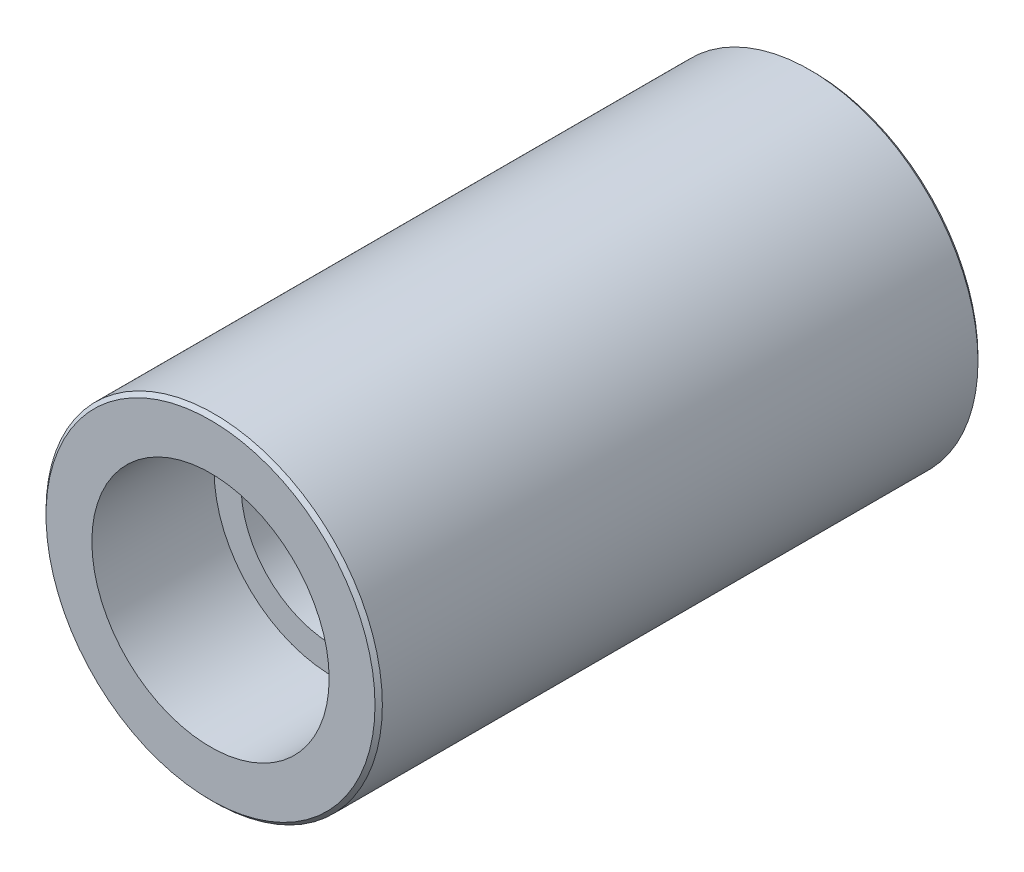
ISO-10303-21;
HEADER;
FILE_DESCRIPTION(('STEP AP214'),'2;1');
FILE_NAME('part.step','',(''),(''),'','','');
FILE_SCHEMA(('AUTOMOTIVE_DESIGN { 1 0 10303 214 1 1 1 1 }'));
ENDSEC;
DATA;
#1=APPLICATION_CONTEXT('core data for automotive mechanical design processes');
#2=APPLICATION_PROTOCOL_DEFINITION('international standard','automotive_design',2000,#1);
#3=PRODUCT_CONTEXT('',#1,'mechanical');
#4=PRODUCT('Part','Part','',(#3));
#5=PRODUCT_RELATED_PRODUCT_CATEGORY('part','',(#4));
#6=PRODUCT_DEFINITION_FORMATION('','',#4);
#7=PRODUCT_DEFINITION_CONTEXT('part definition',#1,'design');
#8=PRODUCT_DEFINITION('design','',#6,#7);
#9=PRODUCT_DEFINITION_SHAPE('','',#8);
#10=(LENGTH_UNIT() NAMED_UNIT(*) SI_UNIT(.MILLI.,.METRE.));
#11=(NAMED_UNIT(*) PLANE_ANGLE_UNIT() SI_UNIT($,.RADIAN.));
#12=(NAMED_UNIT(*) SI_UNIT($,.STERADIAN.) SOLID_ANGLE_UNIT());
#13=UNCERTAINTY_MEASURE_WITH_UNIT(LENGTH_MEASURE(1.E-05),#10,'distance_accuracy_value','');
#14=(GEOMETRIC_REPRESENTATION_CONTEXT(3) GLOBAL_UNCERTAINTY_ASSIGNED_CONTEXT((#13)) GLOBAL_UNIT_ASSIGNED_CONTEXT((#10,
#11,#12)) REPRESENTATION_CONTEXT('',''));
#15=CARTESIAN_POINT('',(0.,0.,0.));
#16=DIRECTION('',(0.,0.,1.));
#17=DIRECTION('',(1.,0.,0.));
#18=AXIS2_PLACEMENT_3D('',#15,#16,#17);
#19=CARTESIAN_POINT('',(0.,0.,0.));
#20=DIRECTION('',(0.,0.,1.));
#21=DIRECTION('',(1.,0.,0.));
#22=AXIS2_PLACEMENT_3D('',#19,#20,#21);
#23=PLANE('',#22);
#24=CARTESIAN_POINT('',(0.,0.,0.));
#25=DIRECTION('',(0.,0.,1.));
#26=DIRECTION('',(1.,0.,0.));
#27=AXIS2_PLACEMENT_3D('',#24,#25,#26);
#28=CIRCLE('',#27,17.0815);
#29=CARTESIAN_POINT('',(17.0815,0.,0.));
#30=VERTEX_POINT('',#29);
#31=EDGE_CURVE('E50',#30,#30,#28,.F.);
#32=ORIENTED_EDGE('',*,*,#31,.T.);
#33=EDGE_LOOP('',(#32));
#34=FACE_BOUND('',#33,.T.);
#35=CARTESIAN_POINT('',(0.,0.,0.));
#36=DIRECTION('',(0.,0.,1.));
#37=DIRECTION('',(1.,0.,0.));
#38=AXIS2_PLACEMENT_3D('',#35,#36,#37);
#39=CIRCLE('',#38,14.4526);
#40=CARTESIAN_POINT('',(-14.4526,0.,0.));
#41=VERTEX_POINT('',#40);
#42=EDGE_CURVE('E85',#41,#41,#39,.T.);
#43=ORIENTED_EDGE('',*,*,#42,.T.);
#44=EDGE_LOOP('',(#43));
#45=FACE_BOUND('',#44,.T.);
#46=ADVANCED_FACE('F42',(#34,#45),#23,.F.);
#47=CARTESIAN_POINT('',(0.,0.,62.611));
#48=DIRECTION('',(0.,0.,-1.));
#49=DIRECTION('',(-1.,0.,0.));
#50=AXIS2_PLACEMENT_3D('',#47,#48,#49);
#51=CYLINDRICAL_SURFACE('',#50,17.4625);
#52=CARTESIAN_POINT('',(0.,0.,0.380999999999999));
#53=DIRECTION('',(0.,0.,1.));
#54=DIRECTION('',(1.,0.,0.));
#55=AXIS2_PLACEMENT_3D('',#52,#53,#54);
#56=CIRCLE('',#55,17.4625);
#57=CARTESIAN_POINT('',(17.4625,0.,0.380999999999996));
#58=VERTEX_POINT('',#57);
#59=EDGE_CURVE('E57',#58,#58,#56,.T.);
#60=ORIENTED_EDGE('',*,*,#59,.T.);
#61=EDGE_LOOP('',(#60));
#62=FACE_BOUND('',#61,.T.);
#63=CARTESIAN_POINT('',(0.,0.,62.23));
#64=DIRECTION('',(0.,0.,1.));
#65=DIRECTION('',(1.,0.,0.));
#66=AXIS2_PLACEMENT_3D('',#63,#64,#65);
#67=CIRCLE('',#66,17.4625);
#68=CARTESIAN_POINT('',(17.4625,0.,62.23));
#69=VERTEX_POINT('',#68);
#70=EDGE_CURVE('E64',#69,#69,#67,.F.);
#71=ORIENTED_EDGE('',*,*,#70,.T.);
#72=EDGE_LOOP('',(#71));
#73=FACE_BOUND('',#72,.T.);
#74=ADVANCED_FACE('F144',(#62,#73),#51,.T.);
#75=CARTESIAN_POINT('',(0.,0.,62.611));
#76=DIRECTION('',(0.,0.,1.));
#77=DIRECTION('',(1.,0.,0.));
#78=AXIS2_PLACEMENT_3D('',#75,#76,#77);
#79=PLANE('',#78);
#80=CARTESIAN_POINT('',(0.,0.,62.611));
#81=DIRECTION('',(0.,0.,1.));
#82=DIRECTION('',(1.,0.,0.));
#83=AXIS2_PLACEMENT_3D('',#80,#81,#82);
#84=CIRCLE('',#83,12.319);
#85=CARTESIAN_POINT('',(12.319,0.,62.611));
#86=VERTEX_POINT('',#85);
#87=EDGE_CURVE('E69',#86,#86,#84,.T.);
#88=ORIENTED_EDGE('',*,*,#87,.F.);
#89=EDGE_LOOP('',(#88));
#90=FACE_BOUND('',#89,.T.);
#91=CARTESIAN_POINT('',(0.,0.,62.611));
#92=DIRECTION('',(0.,0.,1.));
#93=DIRECTION('',(1.,0.,0.));
#94=AXIS2_PLACEMENT_3D('',#91,#92,#93);
#95=CIRCLE('',#94,17.0815);
#96=CARTESIAN_POINT('',(17.0815,0.,62.611));
#97=VERTEX_POINT('',#96);
#98=EDGE_CURVE('E10',#97,#97,#95,.T.);
#99=ORIENTED_EDGE('',*,*,#98,.T.);
#100=EDGE_LOOP('',(#99));
#101=FACE_BOUND('',#100,.T.);
#102=ADVANCED_FACE('F141',(#90,#101),#79,.T.);
#103=CARTESIAN_POINT('',(0.,0.,0.380999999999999));
#104=DIRECTION('',(0.,0.,1.));
#105=DIRECTION('',(1.,0.,0.));
#106=AXIS2_PLACEMENT_3D('',#103,#104,#105);
#107=CONICAL_SURFACE('',#106,17.4625,0.785398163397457);
#108=ORIENTED_EDGE('',*,*,#31,.F.);
#109=EDGE_LOOP('',(#108));
#110=FACE_BOUND('',#109,.T.);
#111=ORIENTED_EDGE('',*,*,#59,.F.);
#112=EDGE_LOOP('',(#111));
#113=FACE_BOUND('',#112,.T.);
#114=ADVANCED_FACE('F143',(#110,#113),#107,.T.);
#115=CARTESIAN_POINT('',(0.,0.,62.611));
#116=DIRECTION('',(0.,0.,-1.));
#117=DIRECTION('',(-1.,0.,0.));
#118=AXIS2_PLACEMENT_3D('',#115,#116,#117);
#119=CONICAL_SURFACE('',#118,17.0815,0.785398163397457);
#120=ORIENTED_EDGE('',*,*,#70,.F.);
#121=EDGE_LOOP('',(#120));
#122=FACE_BOUND('',#121,.T.);
#123=ORIENTED_EDGE('',*,*,#98,.F.);
#124=EDGE_LOOP('',(#123));
#125=FACE_BOUND('',#124,.T.);
#126=ADVANCED_FACE('F44',(#122,#125),#119,.T.);
#127=CARTESIAN_POINT('',(0.,0.,49.911));
#128=DIRECTION('',(0.,0.,1.));
#129=DIRECTION('',(1.,0.,0.));
#130=AXIS2_PLACEMENT_3D('',#127,#128,#129);
#131=PLANE('',#130);
#132=CARTESIAN_POINT('',(0.,0.,49.911));
#133=DIRECTION('',(0.,0.,1.));
#134=DIRECTION('',(1.,0.,0.));
#135=AXIS2_PLACEMENT_3D('',#132,#133,#134);
#136=CIRCLE('',#135,9.525);
#137=CARTESIAN_POINT('',(9.52500000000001,0.,49.911));
#138=VERTEX_POINT('',#137);
#139=EDGE_CURVE('E77',#138,#138,#136,.T.);
#140=ORIENTED_EDGE('',*,*,#139,.F.);
#141=EDGE_LOOP('',(#140));
#142=FACE_BOUND('',#141,.T.);
#143=CARTESIAN_POINT('',(0.,0.,49.911));
#144=DIRECTION('',(0.,0.,1.));
#145=DIRECTION('',(1.,0.,0.));
#146=AXIS2_PLACEMENT_3D('',#143,#144,#145);
#147=CIRCLE('',#146,12.319);
#148=CARTESIAN_POINT('',(12.319,0.,49.911));
#149=VERTEX_POINT('',#148);
#150=EDGE_CURVE('E73',#149,#149,#147,.T.);
#151=ORIENTED_EDGE('',*,*,#150,.T.);
#152=EDGE_LOOP('',(#151));
#153=FACE_BOUND('',#152,.T.);
#154=ADVANCED_FACE('F130',(#142,#153),#131,.T.);
#155=CARTESIAN_POINT('',(0.,0.,49.911));
#156=DIRECTION('',(0.,0.,1.));
#157=DIRECTION('',(1.,0.,0.));
#158=AXIS2_PLACEMENT_3D('',#155,#156,#157);
#159=CYLINDRICAL_SURFACE('',#158,12.319);
#160=ORIENTED_EDGE('',*,*,#150,.F.);
#161=EDGE_LOOP('',(#160));
#162=FACE_BOUND('',#161,.T.);
#163=ORIENTED_EDGE('',*,*,#87,.T.);
#164=EDGE_LOOP('',(#163));
#165=FACE_BOUND('',#164,.T.);
#166=ADVANCED_FACE('F126',(#162,#165),#159,.F.);
#167=CARTESIAN_POINT('',(0.,0.,0.));
#168=DIRECTION('',(0.,0.,1.));
#169=DIRECTION('',(1.,0.,0.));
#170=AXIS2_PLACEMENT_3D('',#167,#168,#169);
#171=CYLINDRICAL_SURFACE('',#170,9.525);
#172=CARTESIAN_POINT('',(0.,0.,27.94));
#173=DIRECTION('',(0.,0.,-1.));
#174=DIRECTION('',(-1.,0.,0.));
#175=AXIS2_PLACEMENT_3D('',#172,#173,#174);
#176=CIRCLE('',#175,9.525);
#177=CARTESIAN_POINT('',(-9.525,0.,27.94));
#178=VERTEX_POINT('',#177);
#179=EDGE_CURVE('E105',#178,#178,#176,.F.);
#180=ORIENTED_EDGE('',*,*,#179,.F.);
#181=EDGE_LOOP('',(#180));
#182=FACE_BOUND('',#181,.T.);
#183=ORIENTED_EDGE('',*,*,#139,.T.);
#184=EDGE_LOOP('',(#183));
#185=FACE_BOUND('',#184,.T.);
#186=ADVANCED_FACE('F122',(#182,#185),#171,.F.);
#187=CARTESIAN_POINT('',(0.,0.,0.787400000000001));
#188=DIRECTION('',(0.,0.,-1.));
#189=DIRECTION('',(-1.,0.,0.));
#190=AXIS2_PLACEMENT_3D('',#187,#188,#189);
#191=PLANE('',#190);
#192=CARTESIAN_POINT('',(0.,0.,0.7874));
#193=DIRECTION('',(0.,0.,-1.));
#194=DIRECTION('',(0.,-1.,0.));
#195=AXIS2_PLACEMENT_3D('',#192,#193,#194);
#196=CIRCLE('',#195,13.4112);
#197=CARTESIAN_POINT('',(0.,-13.4112,0.787399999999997));
#198=VERTEX_POINT('',#197);
#199=EDGE_CURVE('E101',#198,#198,#196,.T.);
#200=ORIENTED_EDGE('',*,*,#199,.F.);
#201=EDGE_LOOP('',(#200));
#202=FACE_BOUND('',#201,.T.);
#203=CARTESIAN_POINT('',(0.,0.,0.787400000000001));
#204=DIRECTION('',(0.,0.,-1.));
#205=DIRECTION('',(-1.,0.,0.));
#206=AXIS2_PLACEMENT_3D('',#203,#204,#205);
#207=CIRCLE('',#206,14.0716);
#208=CARTESIAN_POINT('',(-14.0716,0.,0.787400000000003));
#209=VERTEX_POINT('',#208);
#210=EDGE_CURVE('E89',#209,#209,#207,.F.);
#211=ORIENTED_EDGE('',*,*,#210,.F.);
#212=EDGE_LOOP('',(#211));
#213=FACE_BOUND('',#212,.T.);
#214=ADVANCED_FACE('F125',(#202,#213),#191,.T.);
#215=CARTESIAN_POINT('',(0.,0.,0.381000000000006));
#216=DIRECTION('',(0.,0.,-1.));
#217=DIRECTION('',(-1.,0.,0.));
#218=AXIS2_PLACEMENT_3D('',#215,#216,#217);
#219=CONICAL_SURFACE('',#218,14.0716,0.785398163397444);
#220=CARTESIAN_POINT('',(0.,0.,0.381000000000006));
#221=DIRECTION('',(0.,0.,1.));
#222=DIRECTION('',(1.,0.,0.));
#223=AXIS2_PLACEMENT_3D('',#220,#221,#222);
#224=CIRCLE('',#223,14.0716);
#225=CARTESIAN_POINT('',(-14.0716,0.,0.381000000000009));
#226=VERTEX_POINT('',#225);
#227=EDGE_CURVE('E81',#226,#226,#224,.F.);
#228=CARTESIAN_POINT('',(-14.4526,0.,0.));
#229=CARTESIAN_POINT('',(-14.44863125,0.,0.00396875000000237));
#230=CARTESIAN_POINT('',(-14.4446625,0.,0.00793750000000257));
#231=CARTESIAN_POINT('',(-14.436725,0.,0.015875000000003));
#232=CARTESIAN_POINT('',(-14.43275625,0.,0.0198437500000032));
#233=CARTESIAN_POINT('',(-14.42481875,0.,0.0277812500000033));
#234=CARTESIAN_POINT('',(-14.42085,0.,0.0317500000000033));
#235=CARTESIAN_POINT('',(-14.4129125,0.,0.0396875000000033));
#236=CARTESIAN_POINT('',(-14.40894375,0.,0.0436562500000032));
#237=CARTESIAN_POINT('',(-14.40100625,0.,0.0515937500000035));
#238=CARTESIAN_POINT('',(-14.3970375,0.,0.0555625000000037));
#239=CARTESIAN_POINT('',(-14.3891,0.,0.0635000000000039));
#240=CARTESIAN_POINT('',(-14.38513125,0.,0.0674687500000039));
#241=CARTESIAN_POINT('',(-14.37719375,0.,0.0754062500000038));
#242=CARTESIAN_POINT('',(-14.373225,0.,0.0793750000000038));
#243=CARTESIAN_POINT('',(-14.3652875,0.,0.0873125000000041));
#244=CARTESIAN_POINT('',(-14.36131875,0.,0.0912812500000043));
#245=CARTESIAN_POINT('',(-14.35338125,0.,0.0992187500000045));
#246=CARTESIAN_POINT('',(-14.3494125,0.,0.103187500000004));
#247=CARTESIAN_POINT('',(-14.341475,0.,0.111125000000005));
#248=CARTESIAN_POINT('',(-14.33750625,0.,0.115093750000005));
#249=CARTESIAN_POINT('',(-14.32956875,0.,0.123031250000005));
#250=CARTESIAN_POINT('',(-14.3256,0.,0.127000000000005));
#251=CARTESIAN_POINT('',(-14.3176625,0.,0.134937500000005));
#252=CARTESIAN_POINT('',(-14.31369375,0.,0.138906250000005));
#253=CARTESIAN_POINT('',(-14.30575625,0.,0.146843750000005));
#254=CARTESIAN_POINT('',(-14.3017875,0.,0.150812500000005));
#255=CARTESIAN_POINT('',(-14.29385,0.,0.158750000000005));
#256=CARTESIAN_POINT('',(-14.28988125,0.,0.162718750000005));
#257=CARTESIAN_POINT('',(-14.28194375,0.,0.170656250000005));
#258=CARTESIAN_POINT('',(-14.277975,0.,0.174625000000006));
#259=CARTESIAN_POINT('',(-14.2700375,0.,0.182562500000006));
#260=CARTESIAN_POINT('',(-14.26606875,0.,0.186531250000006));
#261=CARTESIAN_POINT('',(-14.25813125,0.,0.194468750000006));
#262=CARTESIAN_POINT('',(-14.2541625,0.,0.198437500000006));
#263=CARTESIAN_POINT('',(-14.246225,0.,0.206375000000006));
#264=CARTESIAN_POINT('',(-14.24225625,0.,0.210343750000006));
#265=CARTESIAN_POINT('',(-14.23431875,0.,0.218281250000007));
#266=CARTESIAN_POINT('',(-14.23035,0.,0.222250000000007));
#267=CARTESIAN_POINT('',(-14.2224125,0.,0.230187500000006));
#268=CARTESIAN_POINT('',(-14.21844375,0.,0.234156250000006));
#269=CARTESIAN_POINT('',(-14.21050625,0.,0.242093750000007));
#270=CARTESIAN_POINT('',(-14.2065375,0.,0.246062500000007));
#271=CARTESIAN_POINT('',(-14.1986,0.,0.254000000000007));
#272=CARTESIAN_POINT('',(-14.19463125,0.,0.257968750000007));
#273=CARTESIAN_POINT('',(-14.18669375,0.,0.265906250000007));
#274=CARTESIAN_POINT('',(-14.182725,0.,0.269875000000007));
#275=CARTESIAN_POINT('',(-14.1747875,0.,0.277812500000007));
#276=CARTESIAN_POINT('',(-14.17081875,0.,0.281781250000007));
#277=CARTESIAN_POINT('',(-14.16288125,0.,0.289718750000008));
#278=CARTESIAN_POINT('',(-14.1589125,0.,0.293687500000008));
#279=CARTESIAN_POINT('',(-14.150975,0.,0.301625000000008));
#280=CARTESIAN_POINT('',(-14.14700625,0.,0.305593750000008));
#281=CARTESIAN_POINT('',(-14.13906875,0.,0.313531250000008));
#282=CARTESIAN_POINT('',(-14.1351,0.,0.317500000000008));
#283=CARTESIAN_POINT('',(-14.1271625,0.,0.325437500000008));
#284=CARTESIAN_POINT('',(-14.12319375,0.,0.329406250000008));
#285=CARTESIAN_POINT('',(-14.11525625,0.,0.337343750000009));
#286=CARTESIAN_POINT('',(-14.1112875,0.,0.341312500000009));
#287=CARTESIAN_POINT('',(-14.10335,0.,0.349250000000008));
#288=CARTESIAN_POINT('',(-14.09938125,0.,0.353218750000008));
#289=CARTESIAN_POINT('',(-14.09144375,0.,0.361156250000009));
#290=CARTESIAN_POINT('',(-14.087475,0.,0.365125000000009));
#291=CARTESIAN_POINT('',(-14.0795375,0.,0.373062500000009));
#292=CARTESIAN_POINT('',(-14.07556875,0.,0.377031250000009));
#293=CARTESIAN_POINT('',(-14.0716,0.,0.381000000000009));
#294=B_SPLINE_CURVE_WITH_KNOTS('',3,(#228,#229,#230,#231,#232,#233,#234,#235,#236,#237,#238,
#239,#240,#241,#242,#243,#244,#245,#246,#247,#248,#249,#250,#251,#252,#253,#254,#255,#256,#257,
#258,#259,#260,#261,#262,#263,#264,#265,#266,#267,#268,#269,#270,#271,#272,#273,#274,#275,#276,
#277,#278,#279,#280,#281,#282,#283,#284,#285,#286,#287,#288,#289,#290,#291,#292,#293),
.UNSPECIFIED.,.F.,.F.,(4,2,2,2,2,2,2,2,2,2,2,2,2,2,2,2,2,2,2,2,2,2,2,2,2,2,2,2,2,2,2,2,4),(0.,
0.0168379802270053,0.0336759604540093,0.0505139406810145,0.0673519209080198,0.0841899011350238,
0.101027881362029,0.117865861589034,0.134703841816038,0.151541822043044,0.168379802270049,
0.185217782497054,0.202055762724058,0.218893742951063,0.235731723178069,0.252569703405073,
0.269407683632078,0.286245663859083,0.303083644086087,0.319921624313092,0.336759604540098,
0.353597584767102,0.370435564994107,0.387273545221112,0.404111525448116,0.420949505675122,
0.437787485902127,0.454625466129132,0.471463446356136,0.488301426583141,0.505139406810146,
0.521977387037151,0.538815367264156),.UNSPECIFIED.);
#295=EDGE_CURVE('BSEAM160',#41,#226,#294,.T.);
#296=ORIENTED_EDGE('',*,*,#42,.F.);
#297=ORIENTED_EDGE('',*,*,#227,.F.);
#298=ORIENTED_EDGE('',*,*,#295,.T.);
#299=ORIENTED_EDGE('',*,*,#295,.F.);
#300=EDGE_LOOP('',(#296,#298,#297,#299));
#301=FACE_BOUND('',#300,.T.);
#302=ADVANCED_FACE('F160',(#301),#219,.F.);
#303=CARTESIAN_POINT('',(0.,0.,27.94));
#304=DIRECTION('',(0.,0.,-1.));
#305=DIRECTION('',(-1.,0.,0.));
#306=AXIS2_PLACEMENT_3D('',#303,#304,#305);
#307=CYLINDRICAL_SURFACE('',#306,14.0716);
#308=ORIENTED_EDGE('',*,*,#227,.T.);
#309=EDGE_LOOP('',(#308));
#310=FACE_BOUND('',#309,.T.);
#311=ORIENTED_EDGE('',*,*,#210,.T.);
#312=EDGE_LOOP('',(#311));
#313=FACE_BOUND('',#312,.T.);
#314=ADVANCED_FACE('F163',(#310,#313),#307,.F.);
#315=CARTESIAN_POINT('',(0.,0.,0.7874));
#316=DIRECTION('',(0.,0.,-1.));
#317=DIRECTION('',(0.,-1.,0.));
#318=AXIS2_PLACEMENT_3D('',#315,#316,#317);
#319=CYLINDRICAL_SURFACE('',#318,10.795);
#320=CARTESIAN_POINT('',(0.,0.,6.2738));
#321=DIRECTION('',(0.,0.,-1.));
#322=DIRECTION('',(0.,-1.,0.));
#323=AXIS2_PLACEMENT_3D('',#320,#321,#322);
#324=CIRCLE('',#323,10.795);
#325=CARTESIAN_POINT('',(0.,-10.795,6.2738));
#326=VERTEX_POINT('',#325);
#327=EDGE_CURVE('E93',#326,#326,#324,.T.);
#328=ORIENTED_EDGE('',*,*,#327,.T.);
#329=EDGE_LOOP('',(#328));
#330=FACE_BOUND('',#329,.T.);
#331=CARTESIAN_POINT('',(0.,0.,27.94));
#332=DIRECTION('',(0.,0.,-1.));
#333=DIRECTION('',(-1.,0.,0.));
#334=AXIS2_PLACEMENT_3D('',#331,#332,#333);
#335=CIRCLE('',#334,10.795);
#336=CARTESIAN_POINT('',(-10.795,0.,27.94));
#337=VERTEX_POINT('',#336);
#338=EDGE_CURVE('E109',#337,#337,#335,.F.);
#339=ORIENTED_EDGE('',*,*,#338,.T.);
#340=EDGE_LOOP('',(#339));
#341=FACE_BOUND('',#340,.T.);
#342=ADVANCED_FACE('F113',(#330,#341),#319,.F.);
#343=CARTESIAN_POINT('',(0.,0.,2.35303388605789));
#344=DIRECTION('',(0.,0.,-1.));
#345=DIRECTION('',(0.,-1.,0.));
#346=AXIS2_PLACEMENT_3D('',#343,#344,#345);
#347=CONICAL_SURFACE('',#346,11.8455661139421,0.26179938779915);
#348=ORIENTED_EDGE('',*,*,#327,.F.);
#349=EDGE_LOOP('',(#348));
#350=FACE_BOUND('',#349,.T.);
#351=CARTESIAN_POINT('',(0.,0.,2.35303388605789));
#352=DIRECTION('',(0.,0.,-1.));
#353=DIRECTION('',(0.,-1.,0.));
#354=AXIS2_PLACEMENT_3D('',#351,#352,#353);
#355=CIRCLE('',#354,11.8455661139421);
#356=CARTESIAN_POINT('',(0.,-11.8455661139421,2.35303388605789));
#357=VERTEX_POINT('',#356);
#358=EDGE_CURVE('E97',#357,#357,#355,.T.);
#359=ORIENTED_EDGE('',*,*,#358,.T.);
#360=EDGE_LOOP('',(#359));
#361=FACE_BOUND('',#360,.T.);
#362=ADVANCED_FACE('F181',(#350,#361),#347,.F.);
#363=CARTESIAN_POINT('',(0.,0.,0.7874));
#364=DIRECTION('',(0.,0.,-1.));
#365=DIRECTION('',(0.,-1.,0.));
#366=AXIS2_PLACEMENT_3D('',#363,#364,#365);
#367=CONICAL_SURFACE('',#366,13.4112,0.78539816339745);
#368=ORIENTED_EDGE('',*,*,#358,.F.);
#369=EDGE_LOOP('',(#368));
#370=FACE_BOUND('',#369,.T.);
#371=ORIENTED_EDGE('',*,*,#199,.T.);
#372=EDGE_LOOP('',(#371));
#373=FACE_BOUND('',#372,.T.);
#374=ADVANCED_FACE('F118',(#370,#373),#367,.F.);
#375=CARTESIAN_POINT('',(0.,0.,27.94));
#376=DIRECTION('',(0.,0.,-1.));
#377=DIRECTION('',(-1.,0.,0.));
#378=AXIS2_PLACEMENT_3D('',#375,#376,#377);
#379=PLANE('',#378);
#380=ORIENTED_EDGE('',*,*,#338,.F.);
#381=EDGE_LOOP('',(#380));
#382=FACE_BOUND('',#381,.T.);
#383=ORIENTED_EDGE('',*,*,#179,.T.);
#384=EDGE_LOOP('',(#383));
#385=FACE_BOUND('',#384,.T.);
#386=ADVANCED_FACE('F115',(#382,#385),#379,.T.);
#387=CLOSED_SHELL('',(#46,#74,#102,#114,#126,#154,#166,#186,#214,#302,#314,#342,#362,#374,#386));
#388=MANIFOLD_SOLID_BREP('B2',#387);
#389=ADVANCED_BREP_SHAPE_REPRESENTATION('',(#18,#388),#14);
#390=SHAPE_DEFINITION_REPRESENTATION(#9,#389);
ENDSEC;
END-ISO-10303-21;
